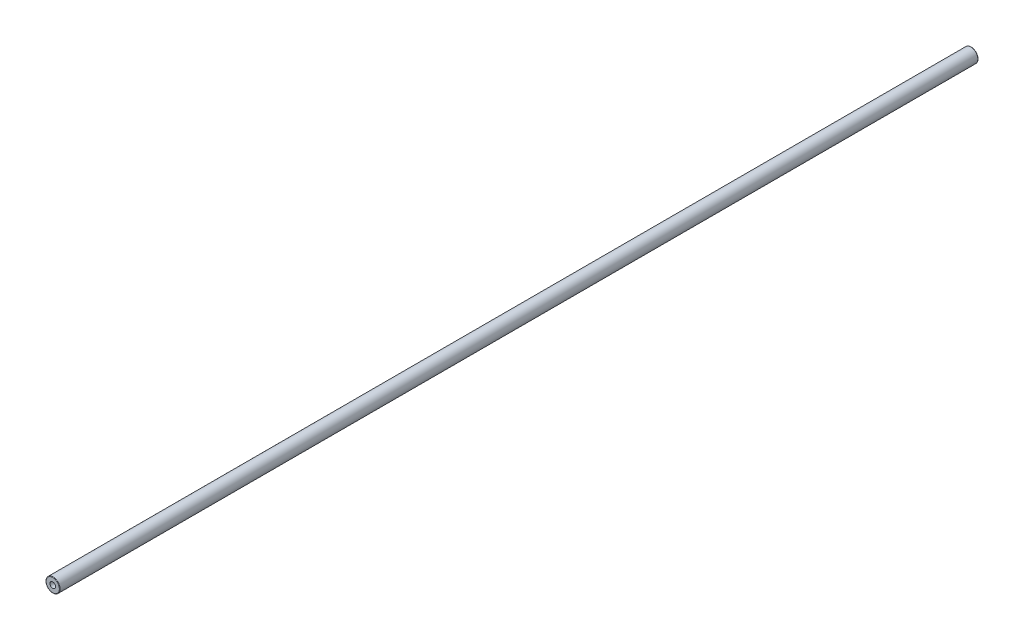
from build123d import *

# Parameters (mm, degrees)
SKETCH1_R           = 7.9375
SKETCH1_R_2         = 3.175
BOSS_EXTRUDE1_DEPTH = 1041.4
FILLET1_R           = 0.508


with BuildPart() as part:
    # Sketch1 → Boss-Extrude1 (new body)
    with BuildSketch(Plane.XY):
        Circle(SKETCH1_R)
        Circle(SKETCH1_R_2, mode=Mode.SUBTRACT)
    extrude(amount=BOSS_EXTRUDE1_DEPTH)

    # Fillet1
    fillet1_edges = [part.edges().sort_by_distance(p)[0] for p in [
        (-7.9375, 0, 0),
        (-7.9375, 0, 1041.4),
    ]]
    fillet(fillet1_edges, radius=FILLET1_R)


solid = part.part
